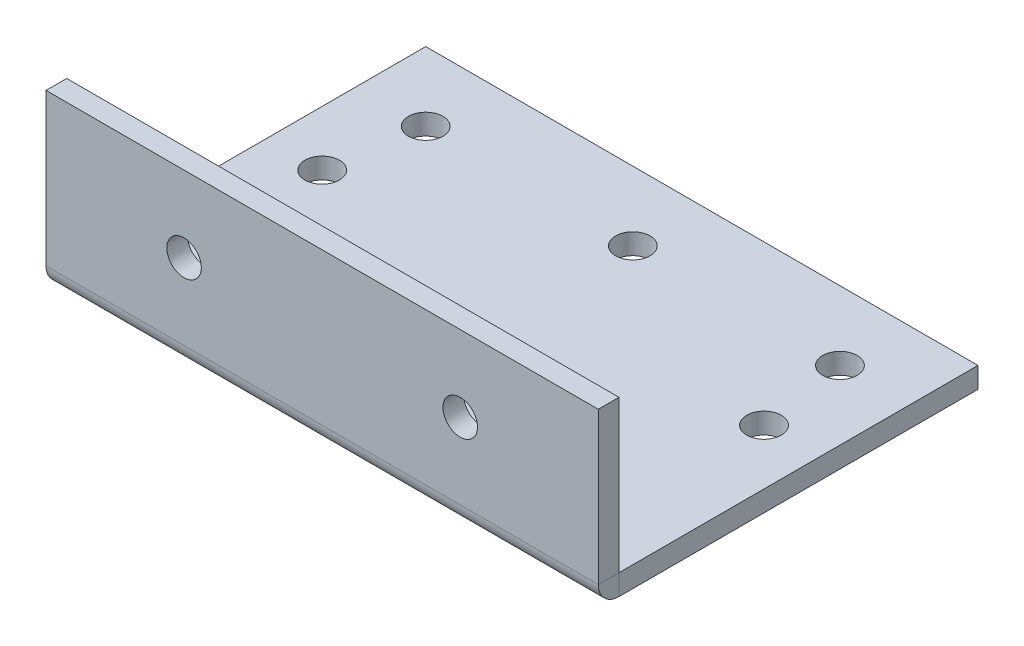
ISO-10303-21;
HEADER;
FILE_DESCRIPTION(('STEP AP214'),'2;1');
FILE_NAME('part.step','',(''),(''),'','','');
FILE_SCHEMA(('AUTOMOTIVE_DESIGN { 1 0 10303 214 1 1 1 1 }'));
ENDSEC;
DATA;
#1=APPLICATION_CONTEXT('core data for automotive mechanical design processes');
#2=APPLICATION_PROTOCOL_DEFINITION('international standard','automotive_design',2000,#1);
#3=PRODUCT_CONTEXT('',#1,'mechanical');
#4=PRODUCT('Part','Part','',(#3));
#5=PRODUCT_RELATED_PRODUCT_CATEGORY('part','',(#4));
#6=PRODUCT_DEFINITION_FORMATION('','',#4);
#7=PRODUCT_DEFINITION_CONTEXT('part definition',#1,'design');
#8=PRODUCT_DEFINITION('design','',#6,#7);
#9=PRODUCT_DEFINITION_SHAPE('','',#8);
#10=(LENGTH_UNIT() NAMED_UNIT(*) SI_UNIT(.MILLI.,.METRE.));
#11=(NAMED_UNIT(*) PLANE_ANGLE_UNIT() SI_UNIT($,.RADIAN.));
#12=(NAMED_UNIT(*) SI_UNIT($,.STERADIAN.) SOLID_ANGLE_UNIT());
#13=UNCERTAINTY_MEASURE_WITH_UNIT(LENGTH_MEASURE(1.E-05),#10,'distance_accuracy_value','');
#14=(GEOMETRIC_REPRESENTATION_CONTEXT(3) GLOBAL_UNCERTAINTY_ASSIGNED_CONTEXT((#13)) GLOBAL_UNIT_ASSIGNED_CONTEXT((#10,
#11,#12)) REPRESENTATION_CONTEXT('',''));
#15=CARTESIAN_POINT('',(0.,0.,0.));
#16=DIRECTION('',(0.,0.,1.));
#17=DIRECTION('',(1.,0.,0.));
#18=AXIS2_PLACEMENT_3D('',#15,#16,#17);
#19=CARTESIAN_POINT('',(0.,-54.995,-24.9949999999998));
#20=DIRECTION('',(0.,0.,1.));
#21=DIRECTION('',(0.,-1.,0.));
#22=AXIS2_PLACEMENT_3D('',#19,#20,#21);
#23=PLANE('',#22);
#24=CARTESIAN_POINT('',(20.,14.005,-24.9950000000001));
#25=DIRECTION('',(0.,0.,-1.));
#26=DIRECTION('',(0.,1.,0.));
#27=AXIS2_PLACEMENT_3D('',#24,#25,#26);
#28=CIRCLE('',#27,2.5);
#29=CARTESIAN_POINT('',(20.,16.505,-24.9950000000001));
#30=VERTEX_POINT('',#29);
#31=EDGE_CURVE('E146',#30,#30,#28,.T.);
#32=ORIENTED_EDGE('',*,*,#31,.T.);
#33=EDGE_LOOP('',(#32));
#34=FACE_BOUND('',#33,.T.);
#35=CARTESIAN_POINT('',(60.,14.005,-24.9950000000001));
#36=DIRECTION('',(0.,0.,-1.));
#37=DIRECTION('',(0.,1.,0.));
#38=AXIS2_PLACEMENT_3D('',#35,#36,#37);
#39=CIRCLE('',#38,2.5);
#40=CARTESIAN_POINT('',(60.,16.505,-24.9950000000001));
#41=VERTEX_POINT('',#40);
#42=EDGE_CURVE('E140',#41,#41,#39,.T.);
#43=ORIENTED_EDGE('',*,*,#42,.T.);
#44=EDGE_LOOP('',(#43));
#45=FACE_BOUND('',#44,.T.);
#46=DIRECTION('',(0.,1.,0.));
#47=VECTOR('',#46,1.);
#48=CARTESIAN_POINT('',(0.,25.005,-24.9950000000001));
#49=LINE('',#48,#47);
#50=CARTESIAN_POINT('',(0.,3.00000000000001,-24.995));
#51=VERTEX_POINT('',#50);
#52=CARTESIAN_POINT('',(0.,25.005,-24.9950000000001));
#53=VERTEX_POINT('',#52);
#54=EDGE_CURVE('E55',#51,#53,#49,.T.);
#55=ORIENTED_EDGE('',*,*,#54,.F.);
#56=DIRECTION('',(1.,0.,0.));
#57=VECTOR('',#56,1.);
#58=CARTESIAN_POINT('',(0.,3.00000000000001,-24.995));
#59=LINE('',#58,#57);
#60=CARTESIAN_POINT('',(80.,3.00000000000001,-24.995));
#61=VERTEX_POINT('',#60);
#62=EDGE_CURVE('E47',#51,#61,#59,.T.);
#63=ORIENTED_EDGE('',*,*,#62,.T.);
#64=DIRECTION('',(0.,-1.,0.));
#65=VECTOR('',#64,1.);
#66=CARTESIAN_POINT('',(80.,25.005,-24.9950000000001));
#67=LINE('',#66,#65);
#68=CARTESIAN_POINT('',(80.,25.005,-24.9950000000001));
#69=VERTEX_POINT('',#68);
#70=EDGE_CURVE('E63',#69,#61,#67,.T.);
#71=ORIENTED_EDGE('',*,*,#70,.F.);
#72=DIRECTION('',(1.,0.,0.));
#73=VECTOR('',#72,1.);
#74=CARTESIAN_POINT('',(0.,25.005,-24.9950000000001));
#75=LINE('',#74,#73);
#76=EDGE_CURVE('E152',#53,#69,#75,.T.);
#77=ORIENTED_EDGE('',*,*,#76,.F.);
#78=EDGE_LOOP('',(#55,#63,#71,#77));
#79=FACE_BOUND('',#78,.T.);
#80=ADVANCED_FACE('F38',(#34,#45,#79),#23,.T.);
#81=CARTESIAN_POINT('',(0.,-54.995,-27.9949999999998));
#82=DIRECTION('',(0.,0.,1.));
#83=DIRECTION('',(0.,-1.,0.));
#84=AXIS2_PLACEMENT_3D('',#81,#82,#83);
#85=PLANE('',#84);
#86=DIRECTION('',(1.,0.,0.));
#87=VECTOR('',#86,1.);
#88=CARTESIAN_POINT('',(0.,3.,-27.995));
#89=LINE('',#88,#87);
#90=CARTESIAN_POINT('',(0.,3.,-27.995));
#91=VERTEX_POINT('',#90);
#92=CARTESIAN_POINT('',(80.,3.,-27.995));
#93=VERTEX_POINT('',#92);
#94=EDGE_CURVE('E173',#91,#93,#89,.T.);
#95=ORIENTED_EDGE('',*,*,#94,.F.);
#96=DIRECTION('',(0.,1.,0.));
#97=VECTOR('',#96,1.);
#98=CARTESIAN_POINT('',(0.,25.005,-27.9950000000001));
#99=LINE('',#98,#97);
#100=CARTESIAN_POINT('',(0.,25.005,-27.9950000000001));
#101=VERTEX_POINT('',#100);
#102=EDGE_CURVE('E42',#91,#101,#99,.T.);
#103=ORIENTED_EDGE('',*,*,#102,.T.);
#104=DIRECTION('',(1.,0.,0.));
#105=VECTOR('',#104,1.);
#106=CARTESIAN_POINT('',(0.,25.005,-27.9950000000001));
#107=LINE('',#106,#105);
#108=CARTESIAN_POINT('',(80.,25.005,-27.9950000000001));
#109=VERTEX_POINT('',#108);
#110=EDGE_CURVE('E154',#101,#109,#107,.T.);
#111=ORIENTED_EDGE('',*,*,#110,.T.);
#112=DIRECTION('',(0.,-1.,0.));
#113=VECTOR('',#112,1.);
#114=CARTESIAN_POINT('',(80.,25.005,-27.9950000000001));
#115=LINE('',#114,#113);
#116=EDGE_CURVE('E156',#109,#93,#115,.T.);
#117=ORIENTED_EDGE('',*,*,#116,.T.);
#118=EDGE_LOOP('',(#95,#103,#111,#117));
#119=FACE_BOUND('',#118,.T.);
#120=CARTESIAN_POINT('',(20.,14.005,-27.9950000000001));
#121=DIRECTION('',(0.,0.,-1.));
#122=DIRECTION('',(0.,1.,0.));
#123=AXIS2_PLACEMENT_3D('',#120,#121,#122);
#124=CIRCLE('',#123,2.5);
#125=CARTESIAN_POINT('',(20.,16.505,-27.9950000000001));
#126=VERTEX_POINT('',#125);
#127=EDGE_CURVE('E149',#126,#126,#124,.T.);
#128=ORIENTED_EDGE('',*,*,#127,.F.);
#129=EDGE_LOOP('',(#128));
#130=FACE_BOUND('',#129,.T.);
#131=CARTESIAN_POINT('',(60.,14.005,-27.9950000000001));
#132=DIRECTION('',(0.,0.,-1.));
#133=DIRECTION('',(0.,1.,0.));
#134=AXIS2_PLACEMENT_3D('',#131,#132,#133);
#135=CIRCLE('',#134,2.5);
#136=CARTESIAN_POINT('',(60.,16.505,-27.9950000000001));
#137=VERTEX_POINT('',#136);
#138=EDGE_CURVE('E143',#137,#137,#135,.T.);
#139=ORIENTED_EDGE('',*,*,#138,.F.);
#140=EDGE_LOOP('',(#139));
#141=FACE_BOUND('',#140,.T.);
#142=ADVANCED_FACE('F170',(#119,#130,#141),#85,.F.);
#143=CARTESIAN_POINT('',(0.,25.005,-27.9950000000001));
#144=DIRECTION('',(1.,0.,0.));
#145=DIRECTION('',(0.,-1.,0.));
#146=AXIS2_PLACEMENT_3D('',#143,#144,#145);
#147=PLANE('',#146);
#148=DIRECTION('',(0.,0.,-1.));
#149=VECTOR('',#148,1.);
#150=CARTESIAN_POINT('',(0.,3.,-27.995));
#151=LINE('',#150,#149);
#152=EDGE_CURVE('E12',#51,#91,#151,.T.);
#153=ORIENTED_EDGE('',*,*,#152,.F.);
#154=ORIENTED_EDGE('',*,*,#54,.T.);
#155=DIRECTION('',(0.,0.,1.));
#156=VECTOR('',#155,1.);
#157=CARTESIAN_POINT('',(0.,25.005,-27.9950000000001));
#158=LINE('',#157,#156);
#159=EDGE_CURVE('E159',#101,#53,#158,.T.);
#160=ORIENTED_EDGE('',*,*,#159,.F.);
#161=ORIENTED_EDGE('',*,*,#102,.F.);
#162=EDGE_LOOP('',(#153,#154,#160,#161));
#163=FACE_BOUND('',#162,.T.);
#164=ADVANCED_FACE('F40',(#163),#147,.F.);
#165=CARTESIAN_POINT('',(0.,25.005,-27.9950000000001));
#166=DIRECTION('',(0.,-1.,0.));
#167=DIRECTION('',(-1.,0.,0.));
#168=AXIS2_PLACEMENT_3D('',#165,#166,#167);
#169=PLANE('',#168);
#170=ORIENTED_EDGE('',*,*,#76,.T.);
#171=DIRECTION('',(0.,0.,1.));
#172=VECTOR('',#171,1.);
#173=CARTESIAN_POINT('',(80.,25.005,-27.9950000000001));
#174=LINE('',#173,#172);
#175=EDGE_CURVE('E157',#109,#69,#174,.T.);
#176=ORIENTED_EDGE('',*,*,#175,.F.);
#177=ORIENTED_EDGE('',*,*,#110,.F.);
#178=ORIENTED_EDGE('',*,*,#159,.T.);
#179=EDGE_LOOP('',(#170,#176,#177,#178));
#180=FACE_BOUND('',#179,.T.);
#181=ADVANCED_FACE('F258',(#180),#169,.F.);
#182=CARTESIAN_POINT('',(80.,25.005,-27.9950000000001));
#183=DIRECTION('',(-1.,0.,0.));
#184=DIRECTION('',(0.,1.,0.));
#185=AXIS2_PLACEMENT_3D('',#182,#183,#184);
#186=PLANE('',#185);
#187=DIRECTION('',(0.,0.,1.));
#188=VECTOR('',#187,1.);
#189=CARTESIAN_POINT('',(80.,3.,-27.995));
#190=LINE('',#189,#188);
#191=EDGE_CURVE('E162',#93,#61,#190,.T.);
#192=ORIENTED_EDGE('',*,*,#191,.F.);
#193=ORIENTED_EDGE('',*,*,#116,.F.);
#194=ORIENTED_EDGE('',*,*,#175,.T.);
#195=ORIENTED_EDGE('',*,*,#70,.T.);
#196=EDGE_LOOP('',(#192,#193,#194,#195));
#197=FACE_BOUND('',#196,.T.);
#198=ADVANCED_FACE('F177',(#197),#186,.F.);
#199=CARTESIAN_POINT('',(20.,14.005,-27.9950000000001));
#200=DIRECTION('',(0.,0.,1.));
#201=DIRECTION('',(0.,-1.,0.));
#202=AXIS2_PLACEMENT_3D('',#199,#200,#201);
#203=CYLINDRICAL_SURFACE('',#202,2.5);
#204=ORIENTED_EDGE('',*,*,#127,.T.);
#205=EDGE_LOOP('',(#204));
#206=FACE_BOUND('',#205,.T.);
#207=ORIENTED_EDGE('',*,*,#31,.F.);
#208=EDGE_LOOP('',(#207));
#209=FACE_BOUND('',#208,.T.);
#210=ADVANCED_FACE('F257',(#206,#209),#203,.F.);
#211=CARTESIAN_POINT('',(60.,14.005,-27.9950000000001));
#212=DIRECTION('',(0.,0.,1.));
#213=DIRECTION('',(0.,-1.,0.));
#214=AXIS2_PLACEMENT_3D('',#211,#212,#213);
#215=CYLINDRICAL_SURFACE('',#214,2.5);
#216=ORIENTED_EDGE('',*,*,#138,.T.);
#217=EDGE_LOOP('',(#216));
#218=FACE_BOUND('',#217,.T.);
#219=ORIENTED_EDGE('',*,*,#42,.F.);
#220=EDGE_LOOP('',(#219));
#221=FACE_BOUND('',#220,.T.);
#222=ADVANCED_FACE('F246',(#218,#221),#215,.F.);
#223=CARTESIAN_POINT('',(0.,3.,-80.));
#224=DIRECTION('',(0.,0.,1.));
#225=DIRECTION('',(1.,0.,0.));
#226=AXIS2_PLACEMENT_3D('',#223,#224,#225);
#227=PLANE('',#226);
#228=DIRECTION('',(-1.,0.,0.));
#229=VECTOR('',#228,1.);
#230=CARTESIAN_POINT('',(0.,0.,-80.));
#231=LINE('',#230,#229);
#232=CARTESIAN_POINT('',(80.,0.,-80.));
#233=VERTEX_POINT('',#232);
#234=CARTESIAN_POINT('',(0.,0.,-80.));
#235=VERTEX_POINT('',#234);
#236=EDGE_CURVE('E134',#233,#235,#231,.T.);
#237=ORIENTED_EDGE('',*,*,#236,.T.);
#238=DIRECTION('',(0.,-1.,0.));
#239=VECTOR('',#238,1.);
#240=CARTESIAN_POINT('',(0.,3.,-80.));
#241=LINE('',#240,#239);
#242=CARTESIAN_POINT('',(0.,3.,-80.));
#243=VERTEX_POINT('',#242);
#244=EDGE_CURVE('E118',#243,#235,#241,.T.);
#245=ORIENTED_EDGE('',*,*,#244,.F.);
#246=DIRECTION('',(-1.,0.,0.));
#247=VECTOR('',#246,1.);
#248=CARTESIAN_POINT('',(0.,3.,-80.));
#249=LINE('',#248,#247);
#250=CARTESIAN_POINT('',(80.,3.,-80.));
#251=VERTEX_POINT('',#250);
#252=EDGE_CURVE('E183',#251,#243,#249,.T.);
#253=ORIENTED_EDGE('',*,*,#252,.F.);
#254=DIRECTION('',(0.,-1.,0.));
#255=VECTOR('',#254,1.);
#256=CARTESIAN_POINT('',(80.,3.,-80.));
#257=LINE('',#256,#255);
#258=EDGE_CURVE('E136',#251,#233,#257,.T.);
#259=ORIENTED_EDGE('',*,*,#258,.T.);
#260=EDGE_LOOP('',(#237,#245,#253,#259));
#261=FACE_BOUND('',#260,.T.);
#262=ADVANCED_FACE('F213',(#261),#227,.F.);
#263=CARTESIAN_POINT('',(72.,3.,-57.));
#264=DIRECTION('',(0.,-1.,0.));
#265=DIRECTION('',(0.,0.,-1.));
#266=AXIS2_PLACEMENT_3D('',#263,#264,#265);
#267=CYLINDRICAL_SURFACE('',#266,2.5);
#268=CARTESIAN_POINT('',(72.,3.,-57.));
#269=DIRECTION('',(0.,1.,0.));
#270=DIRECTION('',(0.,0.,1.));
#271=AXIS2_PLACEMENT_3D('',#268,#269,#270);
#272=CIRCLE('',#271,2.5);
#273=CARTESIAN_POINT('',(72.,3.,-54.5));
#274=VERTEX_POINT('',#273);
#275=EDGE_CURVE('E210',#274,#274,#272,.T.);
#276=ORIENTED_EDGE('',*,*,#275,.T.);
#277=EDGE_LOOP('',(#276));
#278=FACE_BOUND('',#277,.T.);
#279=CARTESIAN_POINT('',(72.,0.,-57.));
#280=DIRECTION('',(0.,1.,0.));
#281=DIRECTION('',(0.,0.,1.));
#282=AXIS2_PLACEMENT_3D('',#279,#280,#281);
#283=CIRCLE('',#282,2.5);
#284=CARTESIAN_POINT('',(72.,0.,-54.5));
#285=VERTEX_POINT('',#284);
#286=EDGE_CURVE('E228',#285,#285,#283,.T.);
#287=ORIENTED_EDGE('',*,*,#286,.F.);
#288=EDGE_LOOP('',(#287));
#289=FACE_BOUND('',#288,.T.);
#290=ADVANCED_FACE('F234',(#278,#289),#267,.F.);
#291=CARTESIAN_POINT('',(70.,3.,-70.));
#292=DIRECTION('',(0.,-1.,0.));
#293=DIRECTION('',(0.,0.,-1.));
#294=AXIS2_PLACEMENT_3D('',#291,#292,#293);
#295=CYLINDRICAL_SURFACE('',#294,2.5);
#296=CARTESIAN_POINT('',(70.,3.,-70.));
#297=DIRECTION('',(0.,1.,0.));
#298=DIRECTION('',(0.,0.,1.));
#299=AXIS2_PLACEMENT_3D('',#296,#297,#298);
#300=CIRCLE('',#299,2.5);
#301=CARTESIAN_POINT('',(70.,3.,-67.5));
#302=VERTEX_POINT('',#301);
#303=EDGE_CURVE('E207',#302,#302,#300,.T.);
#304=ORIENTED_EDGE('',*,*,#303,.T.);
#305=EDGE_LOOP('',(#304));
#306=FACE_BOUND('',#305,.T.);
#307=CARTESIAN_POINT('',(70.,0.,-70.));
#308=DIRECTION('',(0.,1.,0.));
#309=DIRECTION('',(0.,0.,1.));
#310=AXIS2_PLACEMENT_3D('',#307,#308,#309);
#311=CIRCLE('',#310,2.5);
#312=CARTESIAN_POINT('',(70.,0.,-67.5));
#313=VERTEX_POINT('',#312);
#314=EDGE_CURVE('E225',#313,#313,#311,.T.);
#315=ORIENTED_EDGE('',*,*,#314,.F.);
#316=EDGE_LOOP('',(#315));
#317=FACE_BOUND('',#316,.T.);
#318=ADVANCED_FACE('F236',(#306,#317),#295,.F.);
#319=CARTESIAN_POINT('',(10.,3.,-70.));
#320=DIRECTION('',(0.,-1.,0.));
#321=DIRECTION('',(0.,0.,-1.));
#322=AXIS2_PLACEMENT_3D('',#319,#320,#321);
#323=CYLINDRICAL_SURFACE('',#322,2.5);
#324=CARTESIAN_POINT('',(10.,3.,-70.));
#325=DIRECTION('',(0.,1.,0.));
#326=DIRECTION('',(0.,0.,1.));
#327=AXIS2_PLACEMENT_3D('',#324,#325,#326);
#328=CIRCLE('',#327,2.5);
#329=CARTESIAN_POINT('',(10.,3.,-67.5));
#330=VERTEX_POINT('',#329);
#331=EDGE_CURVE('E204',#330,#330,#328,.T.);
#332=ORIENTED_EDGE('',*,*,#331,.T.);
#333=EDGE_LOOP('',(#332));
#334=FACE_BOUND('',#333,.T.);
#335=CARTESIAN_POINT('',(10.,0.,-70.));
#336=DIRECTION('',(0.,1.,0.));
#337=DIRECTION('',(0.,0.,1.));
#338=AXIS2_PLACEMENT_3D('',#335,#336,#337);
#339=CIRCLE('',#338,2.5);
#340=CARTESIAN_POINT('',(10.,0.,-67.5));
#341=VERTEX_POINT('',#340);
#342=EDGE_CURVE('E222',#341,#341,#339,.T.);
#343=ORIENTED_EDGE('',*,*,#342,.F.);
#344=EDGE_LOOP('',(#343));
#345=FACE_BOUND('',#344,.T.);
#346=ADVANCED_FACE('F243',(#334,#345),#323,.F.);
#347=CARTESIAN_POINT('',(40.,3.,-70.));
#348=DIRECTION('',(0.,-1.,0.));
#349=DIRECTION('',(0.,0.,-1.));
#350=AXIS2_PLACEMENT_3D('',#347,#348,#349);
#351=CYLINDRICAL_SURFACE('',#350,2.5);
#352=CARTESIAN_POINT('',(40.,3.,-70.));
#353=DIRECTION('',(0.,1.,0.));
#354=DIRECTION('',(0.,0.,1.));
#355=AXIS2_PLACEMENT_3D('',#352,#353,#354);
#356=CIRCLE('',#355,2.5);
#357=CARTESIAN_POINT('',(40.,3.,-67.5));
#358=VERTEX_POINT('',#357);
#359=EDGE_CURVE('E201',#358,#358,#356,.T.);
#360=ORIENTED_EDGE('',*,*,#359,.T.);
#361=EDGE_LOOP('',(#360));
#362=FACE_BOUND('',#361,.T.);
#363=CARTESIAN_POINT('',(40.,0.,-70.));
#364=DIRECTION('',(0.,1.,0.));
#365=DIRECTION('',(0.,0.,1.));
#366=AXIS2_PLACEMENT_3D('',#363,#364,#365);
#367=CIRCLE('',#366,2.5);
#368=CARTESIAN_POINT('',(40.,0.,-67.5));
#369=VERTEX_POINT('',#368);
#370=EDGE_CURVE('E219',#369,#369,#367,.T.);
#371=ORIENTED_EDGE('',*,*,#370,.F.);
#372=EDGE_LOOP('',(#371));
#373=FACE_BOUND('',#372,.T.);
#374=ADVANCED_FACE('F281',(#362,#373),#351,.F.);
#375=CARTESIAN_POINT('',(8.,3.,-57.));
#376=DIRECTION('',(0.,-1.,0.));
#377=DIRECTION('',(0.,0.,-1.));
#378=AXIS2_PLACEMENT_3D('',#375,#376,#377);
#379=CYLINDRICAL_SURFACE('',#378,2.5);
#380=CARTESIAN_POINT('',(8.,3.,-57.));
#381=DIRECTION('',(0.,1.,0.));
#382=DIRECTION('',(0.,0.,1.));
#383=AXIS2_PLACEMENT_3D('',#380,#381,#382);
#384=CIRCLE('',#383,2.5);
#385=CARTESIAN_POINT('',(8.,3.,-54.5));
#386=VERTEX_POINT('',#385);
#387=EDGE_CURVE('E198',#386,#386,#384,.T.);
#388=ORIENTED_EDGE('',*,*,#387,.T.);
#389=EDGE_LOOP('',(#388));
#390=FACE_BOUND('',#389,.T.);
#391=CARTESIAN_POINT('',(8.,0.,-57.));
#392=DIRECTION('',(0.,1.,0.));
#393=DIRECTION('',(0.,0.,1.));
#394=AXIS2_PLACEMENT_3D('',#391,#392,#393);
#395=CIRCLE('',#394,2.5);
#396=CARTESIAN_POINT('',(8.,0.,-54.5));
#397=VERTEX_POINT('',#396);
#398=EDGE_CURVE('E127',#397,#397,#395,.T.);
#399=ORIENTED_EDGE('',*,*,#398,.F.);
#400=EDGE_LOOP('',(#399));
#401=FACE_BOUND('',#400,.T.);
#402=ADVANCED_FACE('F277',(#390,#401),#379,.F.);
#403=CARTESIAN_POINT('',(0.,3.,-80.));
#404=DIRECTION('',(0.,-1.,0.));
#405=DIRECTION('',(0.,0.,-1.));
#406=AXIS2_PLACEMENT_3D('',#403,#404,#405);
#407=PLANE('',#406);
#408=ORIENTED_EDGE('',*,*,#387,.F.);
#409=EDGE_LOOP('',(#408));
#410=FACE_BOUND('',#409,.T.);
#411=ORIENTED_EDGE('',*,*,#359,.F.);
#412=EDGE_LOOP('',(#411));
#413=FACE_BOUND('',#412,.T.);
#414=ORIENTED_EDGE('',*,*,#331,.F.);
#415=EDGE_LOOP('',(#414));
#416=FACE_BOUND('',#415,.T.);
#417=ORIENTED_EDGE('',*,*,#303,.F.);
#418=EDGE_LOOP('',(#417));
#419=FACE_BOUND('',#418,.T.);
#420=ORIENTED_EDGE('',*,*,#275,.F.);
#421=EDGE_LOOP('',(#420));
#422=FACE_BOUND('',#421,.T.);
#423=DIRECTION('',(0.,0.,1.));
#424=VECTOR('',#423,1.);
#425=CARTESIAN_POINT('',(0.,3.,0.));
#426=LINE('',#425,#424);
#427=EDGE_CURVE('E189',#243,#91,#426,.T.);
#428=ORIENTED_EDGE('',*,*,#427,.T.);
#429=ORIENTED_EDGE('',*,*,#94,.T.);
#430=DIRECTION('',(0.,0.,-1.));
#431=VECTOR('',#430,1.);
#432=CARTESIAN_POINT('',(80.,3.,0.));
#433=LINE('',#432,#431);
#434=EDGE_CURVE('E187',#93,#251,#433,.T.);
#435=ORIENTED_EDGE('',*,*,#434,.T.);
#436=ORIENTED_EDGE('',*,*,#252,.T.);
#437=EDGE_LOOP('',(#428,#429,#435,#436));
#438=FACE_BOUND('',#437,.T.);
#439=ADVANCED_FACE('F186',(#410,#413,#416,#419,#422,#438),#407,.F.);
#440=CARTESIAN_POINT('',(80.,3.,0.));
#441=DIRECTION('',(-1.,0.,0.));
#442=DIRECTION('',(0.,0.,1.));
#443=AXIS2_PLACEMENT_3D('',#440,#441,#442);
#444=PLANE('',#443);
#445=ORIENTED_EDGE('',*,*,#434,.F.);
#446=DIRECTION('',(0.,-1.,0.));
#447=VECTOR('',#446,1.);
#448=CARTESIAN_POINT('',(80.,3.,-27.995));
#449=LINE('',#448,#447);
#450=CARTESIAN_POINT('',(80.,0.,-27.995));
#451=VERTEX_POINT('',#450);
#452=EDGE_CURVE('E179',#93,#451,#449,.T.);
#453=ORIENTED_EDGE('',*,*,#452,.T.);
#454=DIRECTION('',(0.,0.,-1.));
#455=VECTOR('',#454,1.);
#456=CARTESIAN_POINT('',(80.,0.,0.));
#457=LINE('',#456,#455);
#458=EDGE_CURVE('E132',#451,#233,#457,.T.);
#459=ORIENTED_EDGE('',*,*,#458,.T.);
#460=ORIENTED_EDGE('',*,*,#258,.F.);
#461=EDGE_LOOP('',(#445,#453,#459,#460));
#462=FACE_BOUND('',#461,.T.);
#463=ADVANCED_FACE('F191',(#462),#444,.F.);
#464=CARTESIAN_POINT('',(0.,0.,-80.));
#465=DIRECTION('',(0.,-1.,0.));
#466=DIRECTION('',(0.,0.,-1.));
#467=AXIS2_PLACEMENT_3D('',#464,#465,#466);
#468=PLANE('',#467);
#469=DIRECTION('',(1.,0.,0.));
#470=VECTOR('',#469,1.);
#471=CARTESIAN_POINT('',(0.,0.,-27.995));
#472=LINE('',#471,#470);
#473=CARTESIAN_POINT('',(0.,0.,-27.995));
#474=VERTEX_POINT('',#473);
#475=EDGE_CURVE('E106',#474,#451,#472,.T.);
#476=ORIENTED_EDGE('',*,*,#475,.F.);
#477=DIRECTION('',(0.,0.,1.));
#478=VECTOR('',#477,1.);
#479=CARTESIAN_POINT('',(0.,0.,0.));
#480=LINE('',#479,#478);
#481=EDGE_CURVE('E119',#235,#474,#480,.T.);
#482=ORIENTED_EDGE('',*,*,#481,.F.);
#483=ORIENTED_EDGE('',*,*,#236,.F.);
#484=ORIENTED_EDGE('',*,*,#458,.F.);
#485=EDGE_LOOP('',(#476,#482,#483,#484));
#486=FACE_BOUND('',#485,.T.);
#487=ORIENTED_EDGE('',*,*,#286,.T.);
#488=EDGE_LOOP('',(#487));
#489=FACE_BOUND('',#488,.T.);
#490=ORIENTED_EDGE('',*,*,#314,.T.);
#491=EDGE_LOOP('',(#490));
#492=FACE_BOUND('',#491,.T.);
#493=ORIENTED_EDGE('',*,*,#342,.T.);
#494=EDGE_LOOP('',(#493));
#495=FACE_BOUND('',#494,.T.);
#496=ORIENTED_EDGE('',*,*,#370,.T.);
#497=EDGE_LOOP('',(#496));
#498=FACE_BOUND('',#497,.T.);
#499=ORIENTED_EDGE('',*,*,#398,.T.);
#500=EDGE_LOOP('',(#499));
#501=FACE_BOUND('',#500,.T.);
#502=ADVANCED_FACE('F130',(#486,#489,#492,#495,#498,#501),#468,.T.);
#503=CARTESIAN_POINT('',(0.,3.,0.));
#504=DIRECTION('',(1.,0.,0.));
#505=DIRECTION('',(0.,0.,-1.));
#506=AXIS2_PLACEMENT_3D('',#503,#504,#505);
#507=PLANE('',#506);
#508=ORIENTED_EDGE('',*,*,#481,.T.);
#509=DIRECTION('',(0.,1.,0.));
#510=VECTOR('',#509,1.);
#511=CARTESIAN_POINT('',(0.,3.,-27.995));
#512=LINE('',#511,#510);
#513=EDGE_CURVE('E112',#474,#91,#512,.T.);
#514=ORIENTED_EDGE('',*,*,#513,.T.);
#515=ORIENTED_EDGE('',*,*,#427,.F.);
#516=ORIENTED_EDGE('',*,*,#244,.T.);
#517=EDGE_LOOP('',(#508,#514,#515,#516));
#518=FACE_BOUND('',#517,.T.);
#519=ADVANCED_FACE('F123',(#518),#507,.F.);
#520=CARTESIAN_POINT('',(0.,3.,-27.995));
#521=DIRECTION('',(-1.,0.,0.));
#522=DIRECTION('',(0.,0.,1.));
#523=AXIS2_PLACEMENT_3D('',#520,#521,#522);
#524=PLANE('',#523);
#525=CARTESIAN_POINT('',(0.,3.,-27.995));
#526=DIRECTION('',(1.,0.,0.));
#527=DIRECTION('',(0.,0.,-1.));
#528=AXIS2_PLACEMENT_3D('',#525,#526,#527);
#529=CIRCLE('',#528,3.);
#530=EDGE_CURVE('E101',#51,#474,#529,.T.);
#531=ORIENTED_EDGE('',*,*,#530,.F.);
#532=ORIENTED_EDGE('',*,*,#152,.T.);
#533=ORIENTED_EDGE('',*,*,#513,.F.);
#534=EDGE_LOOP('',(#531,#532,#533));
#535=FACE_BOUND('',#534,.T.);
#536=ADVANCED_FACE('F114',(#535),#524,.T.);
#537=CARTESIAN_POINT('',(80.,3.,-27.995));
#538=DIRECTION('',(1.,0.,0.));
#539=DIRECTION('',(0.,0.,-1.));
#540=AXIS2_PLACEMENT_3D('',#537,#538,#539);
#541=CYLINDRICAL_SURFACE('',#540,3.);
#542=CARTESIAN_POINT('',(80.,3.,-27.995));
#543=DIRECTION('',(1.,0.,0.));
#544=DIRECTION('',(0.,0.,-1.));
#545=AXIS2_PLACEMENT_3D('',#542,#543,#544);
#546=CIRCLE('',#545,3.);
#547=EDGE_CURVE('E109',#61,#451,#546,.T.);
#548=ORIENTED_EDGE('',*,*,#547,.F.);
#549=ORIENTED_EDGE('',*,*,#62,.F.);
#550=ORIENTED_EDGE('',*,*,#530,.T.);
#551=ORIENTED_EDGE('',*,*,#475,.T.);
#552=EDGE_LOOP('',(#548,#549,#550,#551));
#553=FACE_BOUND('',#552,.T.);
#554=ADVANCED_FACE('F104',(#553),#541,.T.);
#555=CARTESIAN_POINT('',(80.,3.,-27.995));
#556=DIRECTION('',(1.,0.,0.));
#557=DIRECTION('',(0.,0.,-1.));
#558=AXIS2_PLACEMENT_3D('',#555,#556,#557);
#559=PLANE('',#558);
#560=ORIENTED_EDGE('',*,*,#191,.T.);
#561=ORIENTED_EDGE('',*,*,#547,.T.);
#562=ORIENTED_EDGE('',*,*,#452,.F.);
#563=EDGE_LOOP('',(#560,#561,#562));
#564=FACE_BOUND('',#563,.T.);
#565=ADVANCED_FACE('F180',(#564),#559,.T.);
#566=CLOSED_SHELL('',(#80,#142,#164,#181,#198,#210,#222,#262,#290,#318,#346,#374,#402,#439,#463,
#502,#519,#536,#554,#565));
#567=MANIFOLD_SOLID_BREP('B2',#566);
#568=ADVANCED_BREP_SHAPE_REPRESENTATION('',(#18,#567),#14);
#569=SHAPE_DEFINITION_REPRESENTATION(#9,#568);
ENDSEC;
END-ISO-10303-21;
